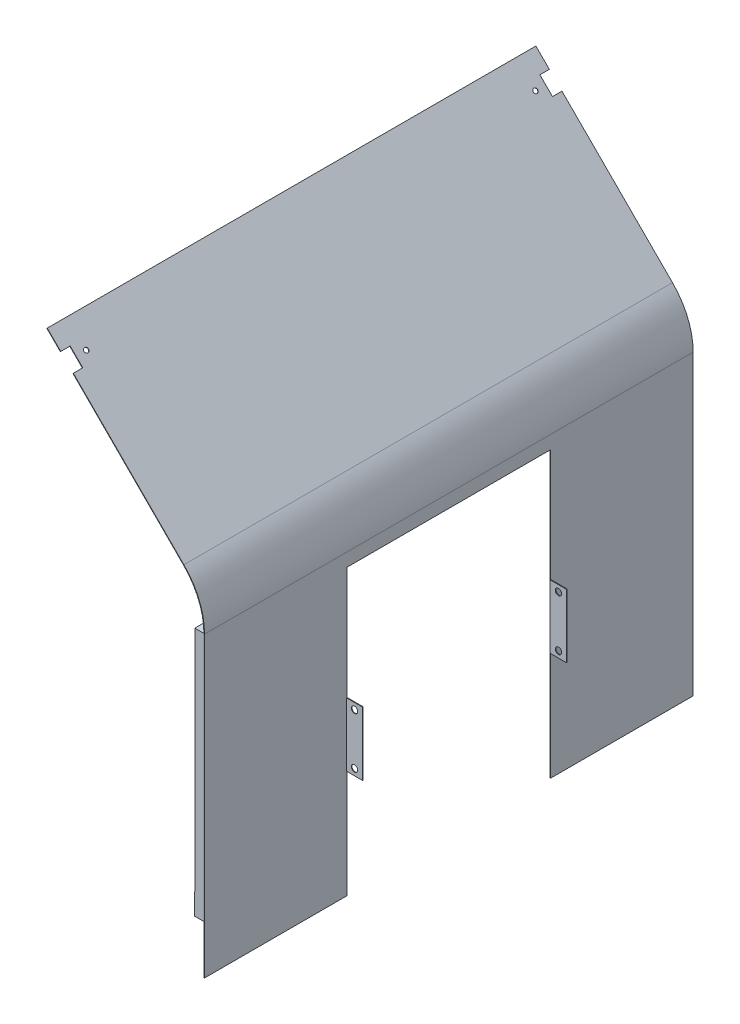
from build123d import *

# Parameters (mm, degrees)
EXTRU_MINCE1_DEPTH      = 769
ESQUISSE4_W             = 697.8718747
ESQUISSE4_H             = 0.9
EXTRU_MINCE2_DEPTH      = 15
ESQUISSE9_W             = 320
ESQUISSE9_H             = 447.74921821
ENL_V_MAT_EXTRU_1_DEPTH = 10
ESQUISSE10_W            = 1
ESQUISSE10_H            = 100
EXTRUSION1_DEPTH        = 26
ESQUISSE11_R            = 5
ENL_V_MAT_EXTRU_2_DEPTH = 376
ESQUISSE12_W            = 0.9
ESQUISSE12_H            = 739.310389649
EXTRUSION2_DEPTH        = 28
ESQUISSE13_W            = 0.9
ESQUISSE13_H            = 739.310389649
ESQUISSE13_H_2          = 769
EXTRUSION3_DEPTH        = 30
ESQUISSE15_R            = 3.5
ENL_V_MAT_EXTRU_4_DEPTH = 10
ESQUISSE16_W            = 0.9
ESQUISSE16_H            = 392.615748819
EXTRU_MINCE9_DEPTH      = 15
EXTRUSION6_DEPTH        = 15


with BuildPart() as part:
    # Esquisse3 → Extru.-Mince1 (new body)
    with BuildSketch(Plane.XY):
        with BuildLine():
            Line((1010, -10), (1010, 458.578643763))
            ThreePointArc((1010, 458.578643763), (1001.626748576, 500.673821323), (977.781745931, 536.360389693))
            Line((977.781745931, 536.360389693), (803.759757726, 710.382377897))
            Line((803.759757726, 710.382377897), (804.396153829, 711.018774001))
            Line((804.396153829, 711.018774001), (978.418142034, 536.996785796))
            ThreePointArc((978.418142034, 536.996785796), (1002.458240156, 501.018236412), (1010.9, 458.578643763))
            Line((1010.9, 458.578643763), (1010.9, -10))
            Line((1010.9, -10), (1010, -10))
        make_face()
    extrude(amount=EXTRU_MINCE1_DEPTH)

    # Esquisse4 → Extru.-Mince2 (add)
    with BuildSketch(Plane.ZY.offset(-1010)):
        with Locations((349.434539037, 459.028643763)):
            Rectangle(ESQUISSE4_W, ESQUISSE4_H)
    extrude(amount=EXTRU_MINCE2_DEPTH)

    # Esquisse9 → Enl_v. mat.-Extru.1 (cut)
    with BuildSketch(Plane.ZY.offset(-1010)):
        with Locations((384.5, 213.874609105)):
            Rectangle(ESQUISSE9_W, ESQUISSE9_H)
    extrude(amount=-ENL_V_MAT_EXTRU_1_DEPTH, mode=Mode.SUBTRACT)

    # Esquisse10 → Extrusion1 (add)
    with BuildSketch(Plane.ZY.offset(-1010)):
        with Locations((224, 210.04)):
            Rectangle(ESQUISSE10_W, ESQUISSE10_H)
        with Locations((545, 210.04)):
            Rectangle(ESQUISSE10_W, ESQUISSE10_H)
    extrude(amount=-EXTRUSION1_DEPTH)

    # Esquisse11 → Enl_v. mat.-Extru.2 (cut)
    with BuildSketch(Plane.XY.offset(545.5)):
        with Locations((1023.5, 250.04)):
            Circle(ESQUISSE11_R)
        with Locations((1023.5, 170.04)):
            Circle(ESQUISSE11_R)
    extrude(amount=-ENL_V_MAT_EXTRU_2_DEPTH, mode=Mode.SUBTRACT)

    # Esquisse12 → Extrusion2 (add)
    with BuildSketch(Plane(origin=(46.688689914, -46.688689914, 0), x_dir=(-0.7071067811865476, -0.7071067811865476, 0), z_dir=(-0.7071067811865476, 0.7071067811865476, 0))):
        with Locations((-1071.11017178, 384.504805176)):
            Rectangle(ESQUISSE12_W, ESQUISSE12_H)
    extrude(amount=EXTRUSION2_DEPTH)

    # Esquisse13 → Extrusion3 (add)
    with BuildSketch(Plane(origin=(26.889700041, -26.889700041, 0), x_dir=(-0.7071067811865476, -0.7071067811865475, 0), z_dir=(-0.7071067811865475, 0.7071067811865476, 0))):
        with Locations((-1071.11017178, 384.504805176)):
            Rectangle(ESQUISSE13_W, ESQUISSE13_H)
        with Locations((-1071.11017178, 384.5)):
            Rectangle(ESQUISSE13_W, ESQUISSE13_H_2)
    extrude(amount=EXTRUSION3_DEPTH)

    # Esquisse15 → Enl_v. mat.-Extru.4 (cut)
    with BuildSketch(Plane(origin=(757.071067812, 757.071067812, 0), x_dir=(0.7071067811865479, -0.7071067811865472, 0), z_dir=(-0.7071067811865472, -0.7071067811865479, 0))):
        with Locations((51.027778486, 738)):
            Circle(ESQUISSE15_R)
        with Locations((51.027778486, 31)):
            Circle(ESQUISSE15_R)
    extrude(amount=-ENL_V_MAT_EXTRU_4_DEPTH, mode=Mode.SUBTRACT)

    # Esquisse16 → Extru.-Mince9 (add)
    with BuildSketch(Plane.ZY.offset(-1010)):
        with Locations((0.948601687, 262.270769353)):
            Rectangle(ESQUISSE16_W, ESQUISSE16_H)
    extrude(amount=EXTRU_MINCE9_DEPTH)

    # Esquisse7 → Extrusion6 (add)
    with BuildSketch(Plane.ZY.offset(-1010)):
        Polygon((768.5, 65.962894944), (697.6, 65.962894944), (697.6, 458.578643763), (768.370476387, 458.578643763), align=None)
    extrude(amount=EXTRUSION6_DEPTH)


solid = part.part
